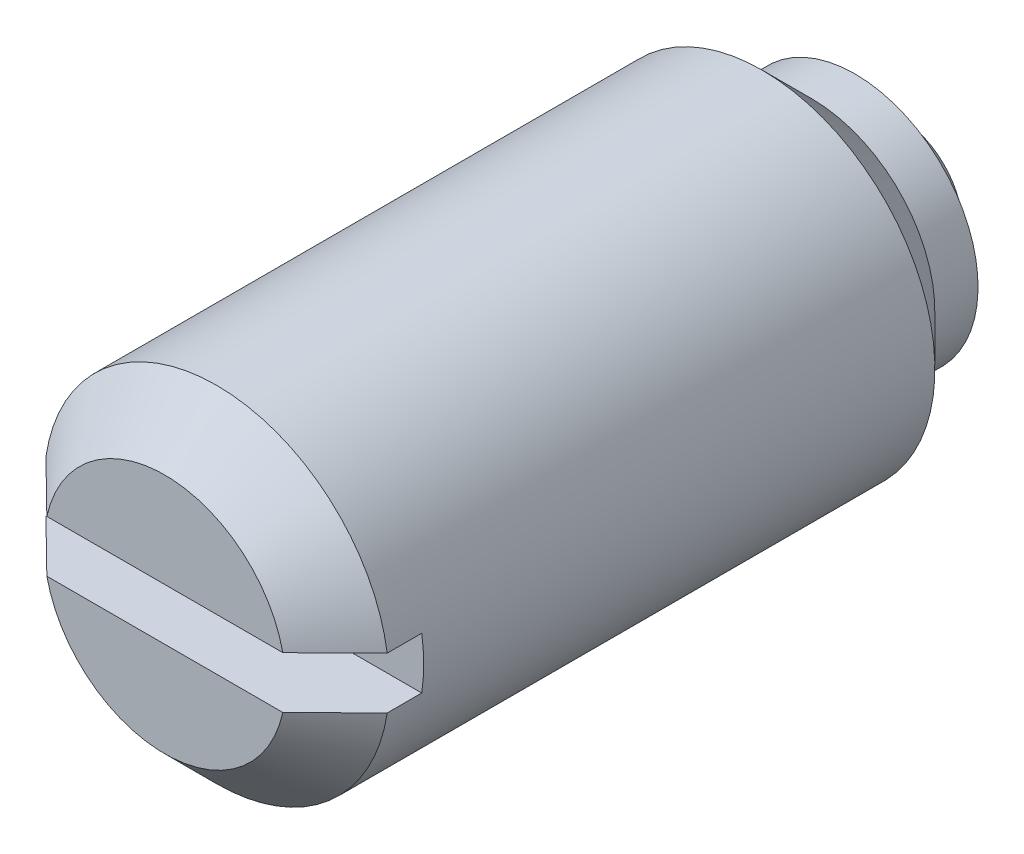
ISO-10303-21;
HEADER;
FILE_DESCRIPTION(('STEP AP214'),'2;1');
FILE_NAME('part.step','',(''),(''),'','','');
FILE_SCHEMA(('AUTOMOTIVE_DESIGN { 1 0 10303 214 1 1 1 1 }'));
ENDSEC;
DATA;
#1=APPLICATION_CONTEXT('core data for automotive mechanical design processes');
#2=APPLICATION_PROTOCOL_DEFINITION('international standard','automotive_design',2000,#1);
#3=PRODUCT_CONTEXT('',#1,'mechanical');
#4=PRODUCT('Part','Part','',(#3));
#5=PRODUCT_RELATED_PRODUCT_CATEGORY('part','',(#4));
#6=PRODUCT_DEFINITION_FORMATION('','',#4);
#7=PRODUCT_DEFINITION_CONTEXT('part definition',#1,'design');
#8=PRODUCT_DEFINITION('design','',#6,#7);
#9=PRODUCT_DEFINITION_SHAPE('','',#8);
#10=(LENGTH_UNIT() NAMED_UNIT(*) SI_UNIT(.MILLI.,.METRE.));
#11=(NAMED_UNIT(*) PLANE_ANGLE_UNIT() SI_UNIT($,.RADIAN.));
#12=(NAMED_UNIT(*) SI_UNIT($,.STERADIAN.) SOLID_ANGLE_UNIT());
#13=UNCERTAINTY_MEASURE_WITH_UNIT(LENGTH_MEASURE(1.E-05),#10,'distance_accuracy_value','');
#14=(GEOMETRIC_REPRESENTATION_CONTEXT(3) GLOBAL_UNCERTAINTY_ASSIGNED_CONTEXT((#13)) GLOBAL_UNIT_ASSIGNED_CONTEXT((#10,
#11,#12)) REPRESENTATION_CONTEXT('',''));
#15=CARTESIAN_POINT('',(0.,0.,0.));
#16=DIRECTION('',(0.,0.,1.));
#17=DIRECTION('',(1.,0.,0.));
#18=AXIS2_PLACEMENT_3D('',#15,#16,#17);
#19=CARTESIAN_POINT('',(0.,4.,17.5));
#20=DIRECTION('',(0.,0.,1.));
#21=DIRECTION('',(1.,0.,0.));
#22=AXIS2_PLACEMENT_3D('',#19,#20,#21);
#23=PLANE('',#22);
#24=CARTESIAN_POINT('',(0.,0.,17.5));
#25=DIRECTION('',(0.,0.,-1.));
#26=DIRECTION('',(0.,1.,0.));
#27=AXIS2_PLACEMENT_3D('',#24,#25,#26);
#28=CIRCLE('',#27,2.8);
#29=CARTESIAN_POINT('',(-2.73495886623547,0.6,17.5));
#30=VERTEX_POINT('',#29);
#31=CARTESIAN_POINT('',(2.73495886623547,0.6,17.5));
#32=VERTEX_POINT('',#31);
#33=EDGE_CURVE('E35',#30,#32,#28,.T.);
#34=ORIENTED_EDGE('',*,*,#33,.F.);
#35=DIRECTION('',(1.,0.,0.));
#36=VECTOR('',#35,1.);
#37=CARTESIAN_POINT('',(-3.95474398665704,0.6,17.5));
#38=LINE('',#37,#36);
#39=EDGE_CURVE('E124',#30,#32,#38,.T.);
#40=ORIENTED_EDGE('',*,*,#39,.T.);
#41=EDGE_LOOP('',(#34,#40));
#42=FACE_BOUND('',#41,.T.);
#43=ADVANCED_FACE('F14',(#42),#23,.T.);
#44=CARTESIAN_POINT('',(0.,0.,-2.5));
#45=DIRECTION('',(0.,0.,-1.));
#46=DIRECTION('',(-1.,0.,0.));
#47=AXIS2_PLACEMENT_3D('',#44,#45,#46);
#48=CYLINDRICAL_SURFACE('',#47,4.);
#49=CARTESIAN_POINT('',(0.,0.,16.3));
#50=DIRECTION('',(0.,0.,-1.));
#51=DIRECTION('',(0.,1.,0.));
#52=AXIS2_PLACEMENT_3D('',#49,#50,#51);
#53=CIRCLE('',#52,4.);
#54=CARTESIAN_POINT('',(3.95474398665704,-0.6,16.3));
#55=VERTEX_POINT('',#54);
#56=CARTESIAN_POINT('',(-3.95474398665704,-0.6,16.3));
#57=VERTEX_POINT('',#56);
#58=EDGE_CURVE('E43',#55,#57,#53,.T.);
#59=ORIENTED_EDGE('',*,*,#58,.T.);
#60=DIRECTION('',(0.,0.,1.));
#61=VECTOR('',#60,1.);
#62=CARTESIAN_POINT('',(-3.95474398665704,-0.6,15.5));
#63=LINE('',#62,#61);
#64=CARTESIAN_POINT('',(-3.95474398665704,-0.6,15.5));
#65=VERTEX_POINT('',#64);
#66=EDGE_CURVE('E101',#65,#57,#63,.T.);
#67=ORIENTED_EDGE('',*,*,#66,.F.);
#68=CARTESIAN_POINT('',(0.,0.,15.5));
#69=DIRECTION('',(0.,0.,1.));
#70=DIRECTION('',(1.,0.,0.));
#71=AXIS2_PLACEMENT_3D('',#68,#69,#70);
#72=CIRCLE('',#71,4.);
#73=CARTESIAN_POINT('',(-3.95474398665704,0.6,15.5));
#74=VERTEX_POINT('',#73);
#75=EDGE_CURVE('E121',#74,#65,#72,.T.);
#76=ORIENTED_EDGE('',*,*,#75,.F.);
#77=DIRECTION('',(0.,0.,1.));
#78=VECTOR('',#77,1.);
#79=CARTESIAN_POINT('',(-3.95474398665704,0.6,15.5));
#80=LINE('',#79,#78);
#81=CARTESIAN_POINT('',(-3.95474398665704,0.6,16.3));
#82=VERTEX_POINT('',#81);
#83=EDGE_CURVE('E90',#74,#82,#80,.T.);
#84=ORIENTED_EDGE('',*,*,#83,.T.);
#85=CARTESIAN_POINT('',(3.95474398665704,0.6,16.3));
#86=VERTEX_POINT('',#85);
#87=EDGE_CURVE('E73',#82,#86,#53,.T.);
#88=ORIENTED_EDGE('',*,*,#87,.T.);
#89=DIRECTION('',(0.,0.,1.));
#90=VECTOR('',#89,1.);
#91=CARTESIAN_POINT('',(3.95474398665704,0.6,15.5));
#92=LINE('',#91,#90);
#93=CARTESIAN_POINT('',(3.95474398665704,0.6,15.5));
#94=VERTEX_POINT('',#93);
#95=EDGE_CURVE('E88',#94,#86,#92,.T.);
#96=ORIENTED_EDGE('',*,*,#95,.F.);
#97=CARTESIAN_POINT('',(3.95474398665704,-0.6,15.5));
#98=VERTEX_POINT('',#97);
#99=EDGE_CURVE('E117',#98,#94,#72,.T.);
#100=ORIENTED_EDGE('',*,*,#99,.F.);
#101=DIRECTION('',(0.,0.,1.));
#102=VECTOR('',#101,1.);
#103=CARTESIAN_POINT('',(3.95474398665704,-0.6,15.5));
#104=LINE('',#103,#102);
#105=EDGE_CURVE('E96',#98,#55,#104,.T.);
#106=ORIENTED_EDGE('',*,*,#105,.T.);
#107=EDGE_LOOP('',(#59,#67,#76,#84,#88,#96,#100,#106));
#108=FACE_BOUND('',#107,.T.);
#109=CARTESIAN_POINT('',(0.,0.,3.65));
#110=DIRECTION('',(0.,0.,-1.));
#111=DIRECTION('',(0.,1.,0.));
#112=AXIS2_PLACEMENT_3D('',#109,#110,#111);
#113=CIRCLE('',#112,4.);
#114=CARTESIAN_POINT('',(0.,4.,3.65));
#115=VERTEX_POINT('',#114);
#116=EDGE_CURVE('E135',#115,#115,#113,.T.);
#117=ORIENTED_EDGE('',*,*,#116,.F.);
#118=EDGE_LOOP('',(#117));
#119=FACE_BOUND('',#118,.T.);
#120=ADVANCED_FACE('F85',(#108,#119),#48,.T.);
#121=CARTESIAN_POINT('',(2.73495886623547,-0.6,17.5));
#122=VERTEX_POINT('',#121);
#123=CARTESIAN_POINT('',(-2.73495886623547,-0.6,17.5));
#124=VERTEX_POINT('',#123);
#125=EDGE_CURVE('E80',#122,#124,#28,.T.);
#126=ORIENTED_EDGE('',*,*,#125,.F.);
#127=DIRECTION('',(1.,0.,0.));
#128=VECTOR('',#127,1.);
#129=CARTESIAN_POINT('',(-3.95474398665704,-0.6,17.5));
#130=LINE('',#129,#128);
#131=EDGE_CURVE('E114',#124,#122,#130,.T.);
#132=ORIENTED_EDGE('',*,*,#131,.F.);
#133=EDGE_LOOP('',(#126,#132));
#134=FACE_BOUND('',#133,.T.);
#135=ADVANCED_FACE('F167',(#134),#23,.T.);
#136=CARTESIAN_POINT('',(-3.95474398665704,0.6,15.5));
#137=DIRECTION('',(0.,-1.,0.));
#138=DIRECTION('',(1.,0.,0.));
#139=AXIS2_PLACEMENT_3D('',#136,#137,#138);
#140=PLANE('',#139);
#141=CARTESIAN_POINT('',(-8.75494398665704,0.6,11.5245202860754));
#142=CARTESIAN_POINT('',(-8.45222932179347,0.6,11.8265209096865));
#143=CARTESIAN_POINT('',(-8.14948337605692,0.6,12.1284902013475));
#144=CARTESIAN_POINT('',(-7.54388127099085,0.6,12.7323327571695));
#145=CARTESIAN_POINT('',(-7.24102510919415,0.6,13.0342060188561));
#146=CARTESIAN_POINT('',(-6.63500344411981,0.6,13.6379740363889));
#147=CARTESIAN_POINT('',(-6.33183786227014,0.6,13.939868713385));
#148=CARTESIAN_POINT('',(-5.72529435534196,0.6,14.5434305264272));
#149=CARTESIAN_POINT('',(-5.42191643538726,0.6,14.8450976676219));
#150=CARTESIAN_POINT('',(-4.81388146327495,0.6,15.4490031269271));
#151=CARTESIAN_POINT('',(-4.50922333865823,0.6,15.7512403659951));
#152=CARTESIAN_POINT('',(-4.05174683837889,0.6,16.2041241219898));
#153=CARTESIAN_POINT('',(-3.89916759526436,0.6,16.3550121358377));
#154=CARTESIAN_POINT('',(-3.59378214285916,0.6,16.6565561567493));
#155=CARTESIAN_POINT('',(-3.44097593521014,0.6,16.8072121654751));
#156=CARTESIAN_POINT('',(-3.13508421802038,0.6,17.10813622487));
#157=CARTESIAN_POINT('',(-2.98199882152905,0.6,17.2584043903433));
#158=CARTESIAN_POINT('',(-2.67530915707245,0.6,17.5584188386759));
#159=CARTESIAN_POINT('',(-2.52170487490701,0.6,17.7081651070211));
#160=CARTESIAN_POINT('',(-2.21367441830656,0.6,18.0067742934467));
#161=CARTESIAN_POINT('',(-2.0592483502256,0.6,18.1556373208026));
#162=CARTESIAN_POINT('',(-1.82642463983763,0.6,18.3776839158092));
#163=CARTESIAN_POINT('',(-1.74862105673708,0.6,18.4514898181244));
#164=CARTESIAN_POINT('',(-1.59243615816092,0.6,18.5984871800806));
#165=CARTESIAN_POINT('',(-1.51405485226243,0.6,18.6716786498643));
#166=CARTESIAN_POINT('',(-1.39233347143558,0.6,18.7839780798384));
#167=CARTESIAN_POINT('',(-1.34930120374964,0.6,18.8234194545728));
#168=CARTESIAN_POINT('',(-1.26289928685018,0.6,18.9019342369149));
#169=CARTESIAN_POINT('',(-1.21952962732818,0.6,18.9410076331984));
#170=CARTESIAN_POINT('',(-1.13231129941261,0.6,19.018697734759));
#171=CARTESIAN_POINT('',(-1.08846222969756,0.6,19.0573139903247));
#172=CARTESIAN_POINT('',(-1.00017689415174,0.6,19.1338660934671));
#173=CARTESIAN_POINT('',(-0.955740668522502,0.6,19.171801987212));
#174=CARTESIAN_POINT('',(-0.874502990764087,0.6,19.2396437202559));
#175=CARTESIAN_POINT('',(-0.837840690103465,0.6,19.2697156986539));
#176=CARTESIAN_POINT('',(-0.763804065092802,0.6,19.3289682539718));
#177=CARTESIAN_POINT('',(-0.726429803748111,0.6,19.3581489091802));
#178=CARTESIAN_POINT('',(-0.650722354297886,0.6,19.4152290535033));
#179=CARTESIAN_POINT('',(-0.612389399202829,0.6,19.4431288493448));
#180=CARTESIAN_POINT('',(-0.534407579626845,0.6,19.4970087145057));
#181=CARTESIAN_POINT('',(-0.49475942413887,0.6,19.5229897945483));
#182=CARTESIAN_POINT('',(-0.414269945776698,0.6,19.5715752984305));
#183=CARTESIAN_POINT('',(-0.373457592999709,0.6,19.5942268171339));
#184=CARTESIAN_POINT('',(-0.28951027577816,0.6,19.6348149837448));
#185=CARTESIAN_POINT('',(-0.246378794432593,0.6,19.6527584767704));
#186=CARTESIAN_POINT('',(-0.167188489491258,0.6,19.6780092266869));
#187=CARTESIAN_POINT('',(-0.131615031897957,0.6,19.6867769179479));
#188=CARTESIAN_POINT('',(-0.0595328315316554,0.6,19.6980945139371));
#189=CARTESIAN_POINT('',(-0.0230270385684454,0.6,19.7006620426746));
#190=CARTESIAN_POINT('',(0.0498941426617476,0.6,19.6990372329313));
#191=CARTESIAN_POINT('',(0.0863092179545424,0.6,19.6948317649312));
#192=CARTESIAN_POINT('',(0.15799128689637,0.6,19.6805529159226));
#193=CARTESIAN_POINT('',(0.193255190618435,0.6,19.6704649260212));
#194=CARTESIAN_POINT('',(0.267687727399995,0.6,19.6440623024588));
#195=CARTESIAN_POINT('',(0.306585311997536,0.6,19.6270125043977));
#196=CARTESIAN_POINT('',(0.382554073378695,0.6,19.5891836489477));
#197=CARTESIAN_POINT('',(0.419621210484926,0.6,19.5683967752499));
#198=CARTESIAN_POINT('',(0.492606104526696,0.6,19.5242351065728));
#199=CARTESIAN_POINT('',(0.528510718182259,0.6,19.5008389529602));
#200=CARTESIAN_POINT('',(0.599162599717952,0.6,19.4524530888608));
#201=CARTESIAN_POINT('',(0.633910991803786,0.6,19.427464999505));
#202=CARTESIAN_POINT('',(0.706148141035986,0.6,19.3737151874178));
#203=CARTESIAN_POINT('',(0.743545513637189,0.6,19.3448314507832));
#204=CARTESIAN_POINT('',(0.817593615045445,0.6,19.2861191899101));
#205=CARTESIAN_POINT('',(0.854244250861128,0.6,19.25629054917));
#206=CARTESIAN_POINT('',(0.963395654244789,0.6,19.1657788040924));
#207=CARTESIAN_POINT('',(1.03506375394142,0.6,19.1040946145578));
#208=CARTESIAN_POINT('',(1.17719886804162,0.6,18.9791404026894));
#209=CARTESIAN_POINT('',(1.24766369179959,0.6,18.9158679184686));
#210=CARTESIAN_POINT('',(1.38772098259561,0.6,18.7884020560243));
#211=CARTESIAN_POINT('',(1.45731367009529,0.6,18.7242089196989));
#212=CARTESIAN_POINT('',(1.59558581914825,0.6,18.5955174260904));
#213=CARTESIAN_POINT('',(1.6642680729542,0.6,18.5310220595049));
#214=CARTESIAN_POINT('',(1.80123053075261,0.6,18.4015973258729));
#215=CARTESIAN_POINT('',(1.86951070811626,0.6,18.3366679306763));
#216=CARTESIAN_POINT('',(2.07377756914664,0.6,18.1415485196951));
#217=CARTESIAN_POINT('',(2.20932605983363,0.6,18.0109001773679));
#218=CARTESIAN_POINT('',(2.47938874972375,0.6,17.7492603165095));
#219=CARTESIAN_POINT('',(2.61390474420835,0.6,17.6182706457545));
#220=CARTESIAN_POINT('',(2.88250534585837,0.6,17.3558495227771));
#221=CARTESIAN_POINT('',(3.01658995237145,0.6,17.2244180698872));
#222=CARTESIAN_POINT('',(3.41842362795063,0.6,16.8296873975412));
#223=CARTESIAN_POINT('',(3.68574807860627,0.6,16.5659562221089));
#224=CARTESIAN_POINT('',(4.219948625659,0.6,16.0377921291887));
#225=CARTESIAN_POINT('',(4.48682445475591,0.6,15.7733589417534));
#226=CARTESIAN_POINT('',(5.02023251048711,0.6,15.2441501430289));
#227=CARTESIAN_POINT('',(5.28676473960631,0.6,14.9793745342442));
#228=CARTESIAN_POINT('',(5.82035037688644,0.6,14.4488750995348));
#229=CARTESIAN_POINT('',(6.08740318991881,0.6,14.1831506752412));
#230=CARTESIAN_POINT('',(6.62136348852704,0.6,13.6515545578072));
#231=CARTESIAN_POINT('',(6.88827097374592,0.6,13.3856828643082));
#232=CARTESIAN_POINT('',(7.42184876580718,0.6,12.8539714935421));
#233=CARTESIAN_POINT('',(7.6885191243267,0.6,12.5881318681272));
#234=CARTESIAN_POINT('',(8.2217827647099,0.6,12.0563767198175));
#235=CARTESIAN_POINT('',(8.48837604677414,0.6,11.7904611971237));
#236=CARTESIAN_POINT('',(8.75494398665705,0.6,11.5245202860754));
#237=B_SPLINE_CURVE_WITH_KNOTS('',3,(#141,#142,#143,#144,#145,#146,#147,#148,#149,#150,#151,
#152,#153,#154,#155,#156,#157,#158,#159,#160,#161,#162,#163,#164,#165,#166,#167,#168,#169,#170,
#171,#172,#173,#174,#175,#176,#177,#178,#179,#180,#181,#182,#183,#184,#185,#186,#187,#188,#189,
#190,#191,#192,#193,#194,#195,#196,#197,#198,#199,#200,#201,#202,#203,#204,#205,#206,#207,#208,
#209,#210,#211,#212,#213,#214,#215,#216,#217,#218,#219,#220,#221,#222,#223,#224,#225,#226,#227,
#228,#229,#230,#231,#232,#233,#234,#235,#236),.UNSPECIFIED.,.F.,.F.,(4,2,2,2,2,2,2,2,2,2,2,2,2,
2,2,2,2,2,2,2,2,2,2,2,2,2,2,2,2,2,2,2,2,2,2,2,2,2,2,2,2,2,2,2,2,2,2,4),(0.,1.28279575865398,
2.56562225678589,3.84915164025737,5.13265105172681,6.42008013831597,7.06384122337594,
7.7075976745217,8.35113453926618,8.99468916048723,9.63816242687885,9.95988465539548,
10.2816015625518,10.456718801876,10.6318414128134,10.8071239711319,10.9823945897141,
11.1246384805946,11.2668698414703,11.4090669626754,11.5511886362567,11.6910520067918,
11.830710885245,11.9401947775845,12.0493670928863,12.1587512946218,12.2684083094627,
12.3955066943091,12.5228740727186,12.6513734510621,12.7797440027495,12.9214806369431,
13.0632348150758,13.3468648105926,13.6309655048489,13.9149928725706,14.1976425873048,
14.4803108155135,15.0450899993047,15.6083611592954,16.171633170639,17.2981959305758,
18.4252841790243,19.5523642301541,20.6825588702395,21.8127562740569,22.9423818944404,
24.0720045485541),.UNSPECIFIED.);
#238=EDGE_CURVE('E79',#82,#30,#237,.T.);
#239=ORIENTED_EDGE('',*,*,#238,.F.);
#240=ORIENTED_EDGE('',*,*,#83,.F.);
#241=DIRECTION('',(1.,0.,0.));
#242=VECTOR('',#241,1.);
#243=CARTESIAN_POINT('',(-3.95474398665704,0.6,15.5));
#244=LINE('',#243,#242);
#245=EDGE_CURVE('E95',#74,#94,#244,.T.);
#246=ORIENTED_EDGE('',*,*,#245,.T.);
#247=ORIENTED_EDGE('',*,*,#95,.T.);
#248=EDGE_CURVE('E70',#32,#86,#237,.T.);
#249=ORIENTED_EDGE('',*,*,#248,.F.);
#250=ORIENTED_EDGE('',*,*,#39,.F.);
#251=EDGE_LOOP('',(#239,#240,#246,#247,#249,#250));
#252=FACE_BOUND('',#251,.T.);
#253=ADVANCED_FACE('F93',(#252),#140,.T.);
#254=CARTESIAN_POINT('',(-3.95474398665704,-0.6,15.5));
#255=DIRECTION('',(0.,-1.,0.));
#256=DIRECTION('',(1.,0.,0.));
#257=AXIS2_PLACEMENT_3D('',#254,#255,#256);
#258=PLANE('',#257);
#259=ORIENTED_EDGE('',*,*,#66,.T.);
#260=CARTESIAN_POINT('',(-8.75494398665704,-0.6,11.5245202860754));
#261=CARTESIAN_POINT('',(-8.45222932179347,-0.6,11.8265209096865));
#262=CARTESIAN_POINT('',(-8.14948337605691,-0.6,12.1284902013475));
#263=CARTESIAN_POINT('',(-7.54388127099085,-0.6,12.7323327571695));
#264=CARTESIAN_POINT('',(-7.24102510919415,-0.6,13.0342060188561));
#265=CARTESIAN_POINT('',(-6.63500344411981,-0.6,13.6379740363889));
#266=CARTESIAN_POINT('',(-6.33183786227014,-0.6,13.939868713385));
#267=CARTESIAN_POINT('',(-5.72529435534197,-0.6,14.5434305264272));
#268=CARTESIAN_POINT('',(-5.42191643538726,-0.6,14.8450976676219));
#269=CARTESIAN_POINT('',(-4.81388146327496,-0.6,15.4490031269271));
#270=CARTESIAN_POINT('',(-4.50922333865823,-0.6,15.7512403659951));
#271=CARTESIAN_POINT('',(-4.05174683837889,-0.6,16.2041241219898));
#272=CARTESIAN_POINT('',(-3.89916759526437,-0.6,16.3550121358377));
#273=CARTESIAN_POINT('',(-3.59378214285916,-0.6,16.6565561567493));
#274=CARTESIAN_POINT('',(-3.44097593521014,-0.6,16.8072121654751));
#275=CARTESIAN_POINT('',(-3.13508421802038,-0.6,17.10813622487));
#276=CARTESIAN_POINT('',(-2.98199882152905,-0.6,17.2584043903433));
#277=CARTESIAN_POINT('',(-2.67530915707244,-0.6,17.5584188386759));
#278=CARTESIAN_POINT('',(-2.52170487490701,-0.6,17.7081651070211));
#279=CARTESIAN_POINT('',(-2.21367441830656,-0.6,18.0067742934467));
#280=CARTESIAN_POINT('',(-2.0592483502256,-0.6,18.1556373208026));
#281=CARTESIAN_POINT('',(-1.82642463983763,-0.6,18.3776839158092));
#282=CARTESIAN_POINT('',(-1.74862105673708,-0.6,18.4514898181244));
#283=CARTESIAN_POINT('',(-1.59243615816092,-0.6,18.5984871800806));
#284=CARTESIAN_POINT('',(-1.51405485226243,-0.6,18.6716786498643));
#285=CARTESIAN_POINT('',(-1.39233347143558,-0.6,18.7839780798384));
#286=CARTESIAN_POINT('',(-1.34930120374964,-0.6,18.8234194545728));
#287=CARTESIAN_POINT('',(-1.26289928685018,-0.6,18.9019342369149));
#288=CARTESIAN_POINT('',(-1.21952962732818,-0.6,18.9410076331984));
#289=CARTESIAN_POINT('',(-1.13231129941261,-0.6,19.018697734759));
#290=CARTESIAN_POINT('',(-1.08846222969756,-0.6,19.0573139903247));
#291=CARTESIAN_POINT('',(-1.00017689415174,-0.6,19.1338660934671));
#292=CARTESIAN_POINT('',(-0.955740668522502,-0.6,19.171801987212));
#293=CARTESIAN_POINT('',(-0.874502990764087,-0.6,19.2396437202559));
#294=CARTESIAN_POINT('',(-0.837840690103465,-0.6,19.2697156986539));
#295=CARTESIAN_POINT('',(-0.763804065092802,-0.6,19.3289682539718));
#296=CARTESIAN_POINT('',(-0.72642980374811,-0.6,19.3581489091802));
#297=CARTESIAN_POINT('',(-0.650722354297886,-0.6,19.4152290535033));
#298=CARTESIAN_POINT('',(-0.612389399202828,-0.6,19.4431288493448));
#299=CARTESIAN_POINT('',(-0.534407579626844,-0.6,19.4970087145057));
#300=CARTESIAN_POINT('',(-0.494759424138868,-0.6,19.5229897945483));
#301=CARTESIAN_POINT('',(-0.414269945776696,-0.6,19.5715752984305));
#302=CARTESIAN_POINT('',(-0.373457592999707,-0.6,19.5942268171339));
#303=CARTESIAN_POINT('',(-0.289510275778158,-0.6,19.6348149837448));
#304=CARTESIAN_POINT('',(-0.246378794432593,-0.6,19.6527584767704));
#305=CARTESIAN_POINT('',(-0.167188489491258,-0.6,19.6780092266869));
#306=CARTESIAN_POINT('',(-0.131615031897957,-0.6,19.6867769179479));
#307=CARTESIAN_POINT('',(-0.0595328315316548,-0.6,19.6980945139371));
#308=CARTESIAN_POINT('',(-0.0230270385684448,-0.6,19.7006620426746));
#309=CARTESIAN_POINT('',(0.0498941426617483,-0.6,19.6990372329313));
#310=CARTESIAN_POINT('',(0.086309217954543,-0.6,19.6948317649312));
#311=CARTESIAN_POINT('',(0.15799128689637,-0.6,19.6805529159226));
#312=CARTESIAN_POINT('',(0.193255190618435,-0.6,19.6704649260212));
#313=CARTESIAN_POINT('',(0.267687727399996,-0.6,19.6440623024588));
#314=CARTESIAN_POINT('',(0.306585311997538,-0.6,19.6270125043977));
#315=CARTESIAN_POINT('',(0.382554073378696,-0.6,19.5891836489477));
#316=CARTESIAN_POINT('',(0.419621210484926,-0.6,19.5683967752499));
#317=CARTESIAN_POINT('',(0.492606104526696,-0.6,19.5242351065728));
#318=CARTESIAN_POINT('',(0.52851071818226,-0.6,19.5008389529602));
#319=CARTESIAN_POINT('',(0.599162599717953,-0.6,19.4524530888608));
#320=CARTESIAN_POINT('',(0.633910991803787,-0.6,19.427464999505));
#321=CARTESIAN_POINT('',(0.706148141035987,-0.6,19.3737151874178));
#322=CARTESIAN_POINT('',(0.743545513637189,-0.6,19.3448314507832));
#323=CARTESIAN_POINT('',(0.817593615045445,-0.6,19.2861191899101));
#324=CARTESIAN_POINT('',(0.854244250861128,-0.6,19.25629054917));
#325=CARTESIAN_POINT('',(0.963395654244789,-0.6,19.1657788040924));
#326=CARTESIAN_POINT('',(1.03506375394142,-0.6,19.1040946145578));
#327=CARTESIAN_POINT('',(1.17719886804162,-0.6,18.9791404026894));
#328=CARTESIAN_POINT('',(1.24766369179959,-0.6,18.9158679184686));
#329=CARTESIAN_POINT('',(1.38772098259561,-0.6,18.7884020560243));
#330=CARTESIAN_POINT('',(1.45731367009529,-0.6,18.7242089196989));
#331=CARTESIAN_POINT('',(1.59558581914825,-0.6,18.5955174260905));
#332=CARTESIAN_POINT('',(1.6642680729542,-0.6,18.5310220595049));
#333=CARTESIAN_POINT('',(1.80123053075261,-0.6,18.4015973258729));
#334=CARTESIAN_POINT('',(1.86951070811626,-0.6,18.3366679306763));
#335=CARTESIAN_POINT('',(2.07377756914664,-0.6,18.1415485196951));
#336=CARTESIAN_POINT('',(2.20932605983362,-0.6,18.0109001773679));
#337=CARTESIAN_POINT('',(2.47938874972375,-0.6,17.7492603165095));
#338=CARTESIAN_POINT('',(2.61390474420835,-0.6,17.6182706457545));
#339=CARTESIAN_POINT('',(2.88250534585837,-0.6,17.3558495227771));
#340=CARTESIAN_POINT('',(3.01658995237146,-0.6,17.2244180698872));
#341=CARTESIAN_POINT('',(3.41842362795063,-0.6,16.8296873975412));
#342=CARTESIAN_POINT('',(3.68574807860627,-0.6,16.5659562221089));
#343=CARTESIAN_POINT('',(4.219948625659,-0.6,16.0377921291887));
#344=CARTESIAN_POINT('',(4.48682445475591,-0.6,15.7733589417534));
#345=CARTESIAN_POINT('',(5.02023251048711,-0.6,15.2441501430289));
#346=CARTESIAN_POINT('',(5.28676473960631,-0.6,14.9793745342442));
#347=CARTESIAN_POINT('',(5.82035037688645,-0.6,14.4488750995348));
#348=CARTESIAN_POINT('',(6.08740318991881,-0.6,14.1831506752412));
#349=CARTESIAN_POINT('',(6.62136348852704,-0.6,13.6515545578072));
#350=CARTESIAN_POINT('',(6.88827097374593,-0.6,13.3856828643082));
#351=CARTESIAN_POINT('',(7.42184876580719,-0.6,12.8539714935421));
#352=CARTESIAN_POINT('',(7.6885191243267,-0.6,12.5881318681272));
#353=CARTESIAN_POINT('',(8.2217827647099,-0.6,12.0563767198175));
#354=CARTESIAN_POINT('',(8.48837604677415,-0.6,11.7904611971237));
#355=CARTESIAN_POINT('',(8.75494398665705,-0.6,11.5245202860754));
#356=B_SPLINE_CURVE_WITH_KNOTS('',3,(#260,#261,#262,#263,#264,#265,#266,#267,#268,#269,#270,
#271,#272,#273,#274,#275,#276,#277,#278,#279,#280,#281,#282,#283,#284,#285,#286,#287,#288,#289,
#290,#291,#292,#293,#294,#295,#296,#297,#298,#299,#300,#301,#302,#303,#304,#305,#306,#307,#308,
#309,#310,#311,#312,#313,#314,#315,#316,#317,#318,#319,#320,#321,#322,#323,#324,#325,#326,#327,
#328,#329,#330,#331,#332,#333,#334,#335,#336,#337,#338,#339,#340,#341,#342,#343,#344,#345,#346,
#347,#348,#349,#350,#351,#352,#353,#354,#355),.UNSPECIFIED.,.F.,.F.,(4,2,2,2,2,2,2,2,2,2,2,2,2,
2,2,2,2,2,2,2,2,2,2,2,2,2,2,2,2,2,2,2,2,2,2,2,2,2,2,2,2,2,2,2,2,2,2,4),(0.,1.28279575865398,
2.56562225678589,3.84915164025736,5.13265105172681,6.42008013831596,7.06384122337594,
7.7075976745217,8.35113453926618,8.99468916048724,9.63816242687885,9.95988465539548,
10.2816015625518,10.456718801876,10.6318414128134,10.8071239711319,10.9823945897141,
11.1246384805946,11.2668698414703,11.4090669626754,11.5511886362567,11.6910520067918,
11.830710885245,11.9401947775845,12.0493670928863,12.1587512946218,12.2684083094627,
12.3955066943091,12.5228740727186,12.6513734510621,12.7797440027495,12.9214806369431,
13.0632348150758,13.3468648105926,13.6309655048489,13.9149928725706,14.1976425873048,
14.4803108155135,15.0450899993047,15.6083611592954,16.171633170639,17.2981959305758,
18.4252841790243,19.5523642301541,20.6825588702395,21.8127562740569,22.9423818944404,
24.0720045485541),.UNSPECIFIED.);
#357=EDGE_CURVE('E9',#57,#124,#356,.T.);
#358=ORIENTED_EDGE('',*,*,#357,.T.);
#359=ORIENTED_EDGE('',*,*,#131,.T.);
#360=EDGE_CURVE('E18',#122,#55,#356,.T.);
#361=ORIENTED_EDGE('',*,*,#360,.T.);
#362=ORIENTED_EDGE('',*,*,#105,.F.);
#363=DIRECTION('',(1.,0.,0.));
#364=VECTOR('',#363,1.);
#365=CARTESIAN_POINT('',(-3.95474398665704,-0.6,15.5));
#366=LINE('',#365,#364);
#367=EDGE_CURVE('E119',#65,#98,#366,.T.);
#368=ORIENTED_EDGE('',*,*,#367,.F.);
#369=EDGE_LOOP('',(#259,#358,#359,#361,#362,#368));
#370=FACE_BOUND('',#369,.T.);
#371=ADVANCED_FACE('F111',(#370),#258,.F.);
#372=CARTESIAN_POINT('',(0.,0.,15.5));
#373=DIRECTION('',(0.,0.,1.));
#374=DIRECTION('',(1.,0.,0.));
#375=AXIS2_PLACEMENT_3D('',#372,#373,#374);
#376=PLANE('',#375);
#377=ORIENTED_EDGE('',*,*,#75,.T.);
#378=ORIENTED_EDGE('',*,*,#367,.T.);
#379=ORIENTED_EDGE('',*,*,#99,.T.);
#380=ORIENTED_EDGE('',*,*,#245,.F.);
#381=EDGE_LOOP('',(#377,#378,#379,#380));
#382=FACE_BOUND('',#381,.T.);
#383=ADVANCED_FACE('F157',(#382),#376,.T.);
#384=CARTESIAN_POINT('',(0.,0.,-2.42278251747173));
#385=DIRECTION('',(0.,0.,-1.));
#386=DIRECTION('',(0.,1.,0.));
#387=AXIS2_PLACEMENT_3D('',#384,#385,#386);
#388=CYLINDRICAL_SURFACE('',#387,2.85);
#389=CARTESIAN_POINT('',(0.,0.,1.5));
#390=DIRECTION('',(0.,0.,-1.));
#391=DIRECTION('',(0.,1.,0.));
#392=AXIS2_PLACEMENT_3D('',#389,#390,#391);
#393=CIRCLE('',#392,2.85);
#394=CARTESIAN_POINT('',(0.,2.85,1.5));
#395=VERTEX_POINT('',#394);
#396=EDGE_CURVE('E127',#395,#395,#393,.T.);
#397=ORIENTED_EDGE('',*,*,#396,.F.);
#398=EDGE_LOOP('',(#397));
#399=FACE_BOUND('',#398,.T.);
#400=CARTESIAN_POINT('',(0.,0.,2.5));
#401=DIRECTION('',(0.,0.,-1.));
#402=DIRECTION('',(0.,1.,0.));
#403=AXIS2_PLACEMENT_3D('',#400,#401,#402);
#404=CIRCLE('',#403,2.85);
#405=CARTESIAN_POINT('',(0.,2.85,2.5));
#406=VERTEX_POINT('',#405);
#407=EDGE_CURVE('E132',#406,#406,#404,.T.);
#408=ORIENTED_EDGE('',*,*,#407,.T.);
#409=EDGE_LOOP('',(#408));
#410=FACE_BOUND('',#409,.T.);
#411=ADVANCED_FACE('F153',(#399,#410),#388,.T.);
#412=CARTESIAN_POINT('',(0.,0.,3.65));
#413=DIRECTION('',(0.,0.,1.));
#414=DIRECTION('',(0.,-1.,0.));
#415=AXIS2_PLACEMENT_3D('',#412,#413,#414);
#416=CONICAL_SURFACE('',#415,4.,0.785398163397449);
#417=ORIENTED_EDGE('',*,*,#407,.F.);
#418=EDGE_LOOP('',(#417));
#419=FACE_BOUND('',#418,.T.);
#420=ORIENTED_EDGE('',*,*,#116,.T.);
#421=EDGE_LOOP('',(#420));
#422=FACE_BOUND('',#421,.T.);
#423=ADVANCED_FACE('F149',(#419,#422),#416,.T.);
#424=CARTESIAN_POINT('',(0.,0.,2.5));
#425=DIRECTION('',(-1.,0.,0.));
#426=DIRECTION('',(0.,0.,1.));
#427=AXIS2_PLACEMENT_3D('',#424,#425,#426);
#428=SPHERICAL_SURFACE('',#427,2.5);
#429=CARTESIAN_POINT('',(0.,0.,2.5));
#430=DIRECTION('',(0.,0.,-1.));
#431=DIRECTION('',(-1.,0.,0.));
#432=AXIS2_PLACEMENT_3D('',#429,#430,#431);
#433=SPHERICAL_SURFACE('',#432,2.5);
#434=CARTESIAN_POINT('',(0.,0.,1.5));
#435=DIRECTION('',(0.,0.,-1.));
#436=DIRECTION('',(-1.,0.,0.));
#437=AXIS2_PLACEMENT_3D('',#434,#435,#436);
#438=CIRCLE('',#437,2.29128784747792);
#439=CARTESIAN_POINT('',(-2.29128784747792,0.,1.5));
#440=VERTEX_POINT('',#439);
#441=EDGE_CURVE('E98',#440,#440,#438,.T.);
#442=ORIENTED_EDGE('',*,*,#441,.T.);
#443=EDGE_LOOP('',(#442));
#444=FACE_BOUND('',#443,.T.);
#445=ADVANCED_FACE('F16',(#444),#433,.T.);
#446=CARTESIAN_POINT('',(0.,2.29128784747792,1.5));
#447=DIRECTION('',(0.,0.,-1.));
#448=DIRECTION('',(-1.,0.,0.));
#449=AXIS2_PLACEMENT_3D('',#446,#447,#448);
#450=PLANE('',#449);
#451=ORIENTED_EDGE('',*,*,#396,.T.);
#452=EDGE_LOOP('',(#451));
#453=FACE_BOUND('',#452,.T.);
#454=ORIENTED_EDGE('',*,*,#441,.F.);
#455=EDGE_LOOP('',(#454));
#456=FACE_BOUND('',#455,.T.);
#457=ADVANCED_FACE('F180',(#453,#456),#450,.T.);
#458=CARTESIAN_POINT('',(0.,0.,17.5));
#459=DIRECTION('',(0.,0.,-1.));
#460=DIRECTION('',(0.,1.,0.));
#461=AXIS2_PLACEMENT_3D('',#458,#459,#460);
#462=CONICAL_SURFACE('',#461,2.8,0.785398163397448);
#463=ORIENTED_EDGE('',*,*,#58,.F.);
#464=ORIENTED_EDGE('',*,*,#360,.F.);
#465=ORIENTED_EDGE('',*,*,#125,.T.);
#466=ORIENTED_EDGE('',*,*,#357,.F.);
#467=EDGE_LOOP('',(#463,#464,#465,#466));
#468=FACE_BOUND('',#467,.T.);
#469=ADVANCED_FACE('F148',(#468),#462,.T.);
#470=ORIENTED_EDGE('',*,*,#238,.T.);
#471=ORIENTED_EDGE('',*,*,#33,.T.);
#472=ORIENTED_EDGE('',*,*,#248,.T.);
#473=ORIENTED_EDGE('',*,*,#87,.F.);
#474=EDGE_LOOP('',(#470,#471,#472,#473));
#475=FACE_BOUND('',#474,.T.);
#476=ADVANCED_FACE('F72',(#475),#462,.T.);
#477=CLOSED_SHELL('',(#43,#120,#135,#253,#371,#383,#411,#423,#445,#457,#469,#476));
#478=MANIFOLD_SOLID_BREP('B1',#477);
#479=ADVANCED_BREP_SHAPE_REPRESENTATION('',(#18,#478),#14);
#480=SHAPE_DEFINITION_REPRESENTATION(#9,#479);
ENDSEC;
END-ISO-10303-21;
